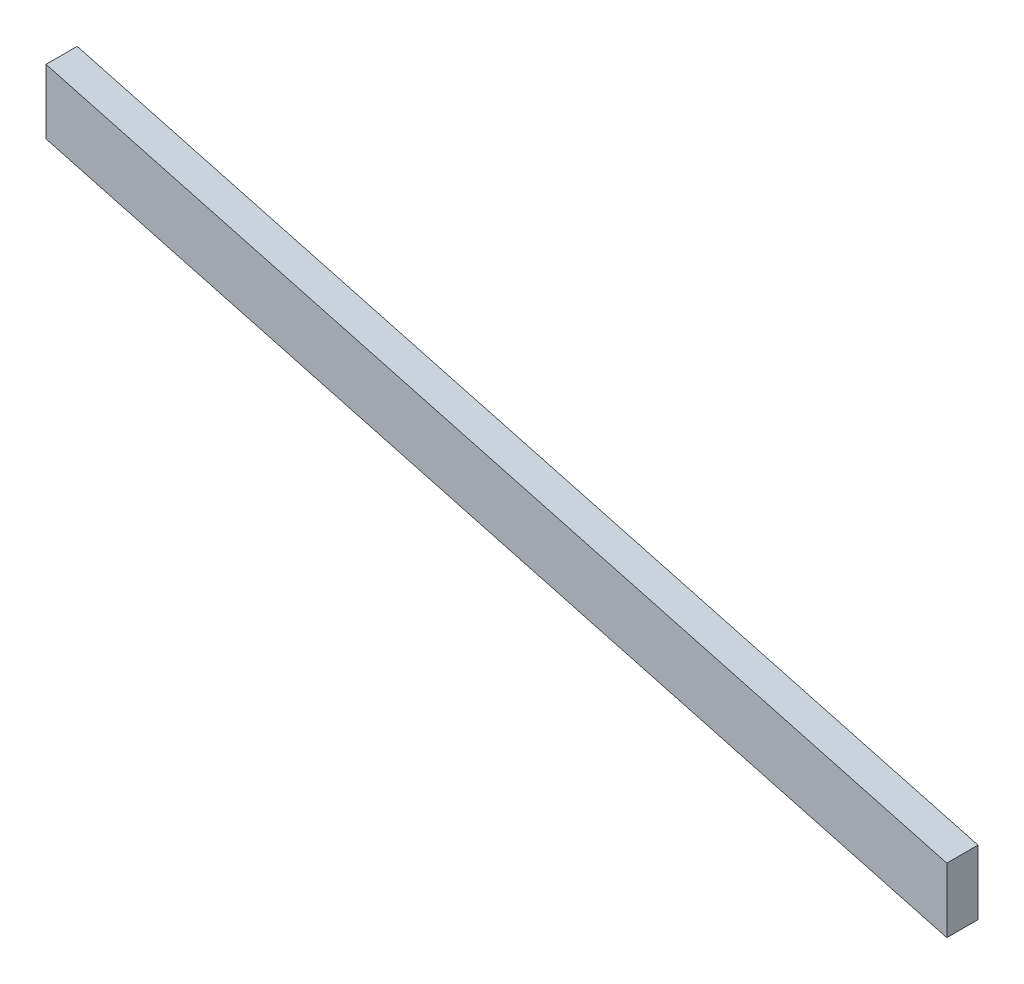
from build123d import *

# Parameters (mm, degrees)
BASE_EXTRUSION_DEPTH = 40


with BuildPart() as part:
    # Esquisse1 → Base-Extrusion (new body)
    with BuildSketch(Plane.XY):
        Polygon((3655.673105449, 3013.890942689), (3655.673105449, 3096.713037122), (2499.880972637, 3406.406605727), (2499.880972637, 3323.584511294), align=None)
    extrude(amount=BASE_EXTRUSION_DEPTH)


solid = part.part
